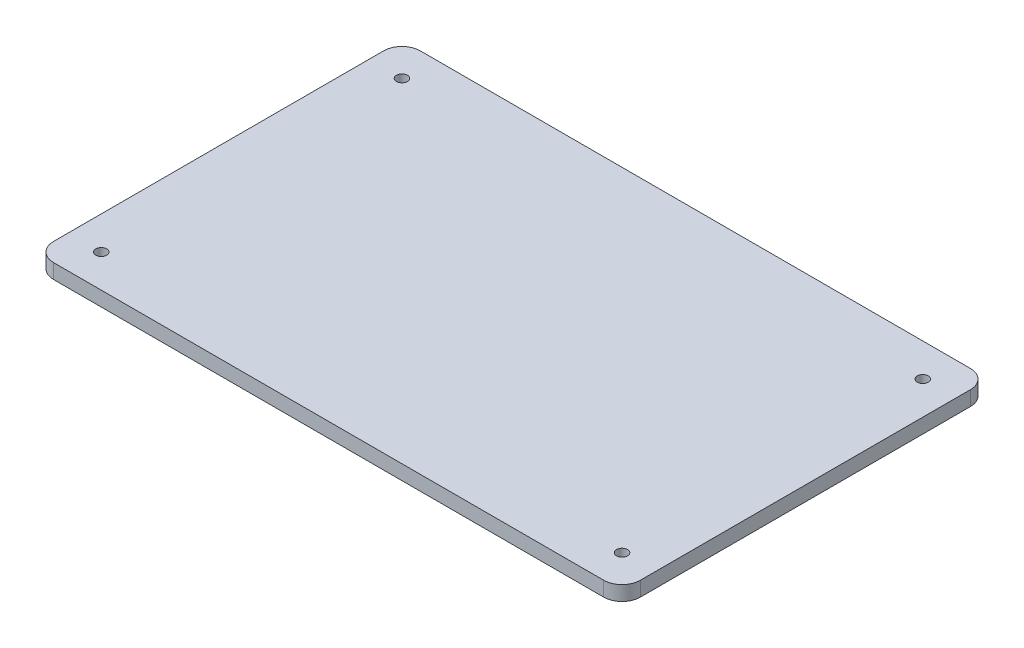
ISO-10303-21;
HEADER;
FILE_DESCRIPTION(('STEP AP214'),'2;1');
FILE_NAME('part.step','',(''),(''),'','','');
FILE_SCHEMA(('AUTOMOTIVE_DESIGN { 1 0 10303 214 1 1 1 1 }'));
ENDSEC;
DATA;
#1=APPLICATION_CONTEXT('core data for automotive mechanical design processes');
#2=APPLICATION_PROTOCOL_DEFINITION('international standard','automotive_design',2000,#1);
#3=PRODUCT_CONTEXT('',#1,'mechanical');
#4=PRODUCT('Part','Part','',(#3));
#5=PRODUCT_RELATED_PRODUCT_CATEGORY('part','',(#4));
#6=PRODUCT_DEFINITION_FORMATION('','',#4);
#7=PRODUCT_DEFINITION_CONTEXT('part definition',#1,'design');
#8=PRODUCT_DEFINITION('design','',#6,#7);
#9=PRODUCT_DEFINITION_SHAPE('','',#8);
#10=(LENGTH_UNIT() NAMED_UNIT(*) SI_UNIT(.MILLI.,.METRE.));
#11=(NAMED_UNIT(*) PLANE_ANGLE_UNIT() SI_UNIT($,.RADIAN.));
#12=(NAMED_UNIT(*) SI_UNIT($,.STERADIAN.) SOLID_ANGLE_UNIT());
#13=UNCERTAINTY_MEASURE_WITH_UNIT(LENGTH_MEASURE(1.E-05),#10,'distance_accuracy_value','');
#14=(GEOMETRIC_REPRESENTATION_CONTEXT(3) GLOBAL_UNCERTAINTY_ASSIGNED_CONTEXT((#13)) GLOBAL_UNIT_ASSIGNED_CONTEXT((#10,
#11,#12)) REPRESENTATION_CONTEXT('',''));
#15=CARTESIAN_POINT('',(0.,0.,0.));
#16=DIRECTION('',(0.,0.,1.));
#17=DIRECTION('',(1.,0.,0.));
#18=AXIS2_PLACEMENT_3D('',#15,#16,#17);
#19=CARTESIAN_POINT('',(0.,4.,0.));
#20=DIRECTION('',(1.,0.,0.));
#21=DIRECTION('',(0.,0.,-1.));
#22=AXIS2_PLACEMENT_3D('',#19,#20,#21);
#23=PLANE('',#22);
#24=DIRECTION('',(0.,0.,1.));
#25=VECTOR('',#24,1.);
#26=CARTESIAN_POINT('',(0.,4.,0.));
#27=LINE('',#26,#25);
#28=CARTESIAN_POINT('',(0.,4.,5.));
#29=VERTEX_POINT('',#28);
#30=CARTESIAN_POINT('',(0.,4.,95.));
#31=VERTEX_POINT('',#30);
#32=EDGE_CURVE('E149',#29,#31,#27,.T.);
#33=ORIENTED_EDGE('',*,*,#32,.F.);
#34=DIRECTION('',(0.,-1.,0.));
#35=VECTOR('',#34,1.);
#36=CARTESIAN_POINT('',(0.,4.,5.));
#37=LINE('',#36,#35);
#38=CARTESIAN_POINT('',(0.,0.,5.));
#39=VERTEX_POINT('',#38);
#40=EDGE_CURVE('E171',#29,#39,#37,.T.);
#41=ORIENTED_EDGE('',*,*,#40,.T.);
#42=DIRECTION('',(0.,0.,1.));
#43=VECTOR('',#42,1.);
#44=CARTESIAN_POINT('',(0.,0.,0.));
#45=LINE('',#44,#43);
#46=CARTESIAN_POINT('',(0.,0.,95.));
#47=VERTEX_POINT('',#46);
#48=EDGE_CURVE('E137',#39,#47,#45,.T.);
#49=ORIENTED_EDGE('',*,*,#48,.T.);
#50=DIRECTION('',(0.,-1.,0.));
#51=VECTOR('',#50,1.);
#52=CARTESIAN_POINT('',(0.,4.,95.));
#53=LINE('',#52,#51);
#54=EDGE_CURVE('E124',#47,#31,#53,.F.);
#55=ORIENTED_EDGE('',*,*,#54,.T.);
#56=EDGE_LOOP('',(#33,#41,#49,#55));
#57=FACE_BOUND('',#56,.T.);
#58=ADVANCED_FACE('F51',(#57),#23,.F.);
#59=CARTESIAN_POINT('',(0.,4.,100.));
#60=DIRECTION('',(0.,0.,-1.));
#61=DIRECTION('',(-1.,0.,0.));
#62=AXIS2_PLACEMENT_3D('',#59,#60,#61);
#63=PLANE('',#62);
#64=DIRECTION('',(1.,0.,0.));
#65=VECTOR('',#64,1.);
#66=CARTESIAN_POINT('',(0.,0.,100.));
#67=LINE('',#66,#65);
#68=CARTESIAN_POINT('',(5.00000000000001,0.,100.));
#69=VERTEX_POINT('',#68);
#70=CARTESIAN_POINT('',(155.,0.,100.));
#71=VERTEX_POINT('',#70);
#72=EDGE_CURVE('E129',#69,#71,#67,.T.);
#73=ORIENTED_EDGE('',*,*,#72,.T.);
#74=DIRECTION('',(0.,-1.,0.));
#75=VECTOR('',#74,1.);
#76=CARTESIAN_POINT('',(155.,4.,100.));
#77=LINE('',#76,#75);
#78=CARTESIAN_POINT('',(155.,4.,100.));
#79=VERTEX_POINT('',#78);
#80=EDGE_CURVE('E60',#71,#79,#77,.F.);
#81=ORIENTED_EDGE('',*,*,#80,.T.);
#82=DIRECTION('',(1.,0.,0.));
#83=VECTOR('',#82,1.);
#84=CARTESIAN_POINT('',(0.,4.,100.));
#85=LINE('',#84,#83);
#86=CARTESIAN_POINT('',(5.00000000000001,4.,100.));
#87=VERTEX_POINT('',#86);
#88=EDGE_CURVE('E130',#87,#79,#85,.T.);
#89=ORIENTED_EDGE('',*,*,#88,.F.);
#90=DIRECTION('',(0.,-1.,0.));
#91=VECTOR('',#90,1.);
#92=CARTESIAN_POINT('',(5.00000000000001,4.,100.));
#93=LINE('',#92,#91);
#94=EDGE_CURVE('E122',#87,#69,#93,.T.);
#95=ORIENTED_EDGE('',*,*,#94,.T.);
#96=EDGE_LOOP('',(#73,#81,#89,#95));
#97=FACE_BOUND('',#96,.T.);
#98=ADVANCED_FACE('F128',(#97),#63,.F.);
#99=CARTESIAN_POINT('',(160.,4.,0.));
#100=DIRECTION('',(-1.,0.,0.));
#101=DIRECTION('',(0.,0.,1.));
#102=AXIS2_PLACEMENT_3D('',#99,#100,#101);
#103=PLANE('',#102);
#104=DIRECTION('',(0.,0.,-1.));
#105=VECTOR('',#104,1.);
#106=CARTESIAN_POINT('',(160.,4.,0.));
#107=LINE('',#106,#105);
#108=CARTESIAN_POINT('',(160.,4.,95.));
#109=VERTEX_POINT('',#108);
#110=CARTESIAN_POINT('',(160.,4.,5.));
#111=VERTEX_POINT('',#110);
#112=EDGE_CURVE('E193',#109,#111,#107,.T.);
#113=ORIENTED_EDGE('',*,*,#112,.F.);
#114=DIRECTION('',(0.,-1.,0.));
#115=VECTOR('',#114,1.);
#116=CARTESIAN_POINT('',(160.,4.,95.));
#117=LINE('',#116,#115);
#118=CARTESIAN_POINT('',(160.,0.,95.));
#119=VERTEX_POINT('',#118);
#120=EDGE_CURVE('E184',#109,#119,#117,.T.);
#121=ORIENTED_EDGE('',*,*,#120,.T.);
#122=DIRECTION('',(0.,0.,-1.));
#123=VECTOR('',#122,1.);
#124=CARTESIAN_POINT('',(160.,0.,0.));
#125=LINE('',#124,#123);
#126=CARTESIAN_POINT('',(160.,0.,5.));
#127=VERTEX_POINT('',#126);
#128=EDGE_CURVE('E136',#119,#127,#125,.T.);
#129=ORIENTED_EDGE('',*,*,#128,.T.);
#130=DIRECTION('',(0.,-1.,0.));
#131=VECTOR('',#130,1.);
#132=CARTESIAN_POINT('',(160.,4.,5.));
#133=LINE('',#132,#131);
#134=EDGE_CURVE('E164',#127,#111,#133,.F.);
#135=ORIENTED_EDGE('',*,*,#134,.T.);
#136=EDGE_LOOP('',(#113,#121,#129,#135));
#137=FACE_BOUND('',#136,.T.);
#138=ADVANCED_FACE('F248',(#137),#103,.F.);
#139=CARTESIAN_POINT('',(0.,4.,0.));
#140=DIRECTION('',(0.,0.,1.));
#141=DIRECTION('',(1.,0.,0.));
#142=AXIS2_PLACEMENT_3D('',#139,#140,#141);
#143=PLANE('',#142);
#144=DIRECTION('',(-1.,0.,0.));
#145=VECTOR('',#144,1.);
#146=CARTESIAN_POINT('',(0.,0.,0.));
#147=LINE('',#146,#145);
#148=CARTESIAN_POINT('',(155.,0.,0.));
#149=VERTEX_POINT('',#148);
#150=CARTESIAN_POINT('',(5.,0.,0.));
#151=VERTEX_POINT('',#150);
#152=EDGE_CURVE('E141',#149,#151,#147,.T.);
#153=ORIENTED_EDGE('',*,*,#152,.T.);
#154=DIRECTION('',(0.,-1.,0.));
#155=VECTOR('',#154,1.);
#156=CARTESIAN_POINT('',(5.,4.,0.));
#157=LINE('',#156,#155);
#158=CARTESIAN_POINT('',(5.,4.,0.));
#159=VERTEX_POINT('',#158);
#160=EDGE_CURVE('E178',#151,#159,#157,.F.);
#161=ORIENTED_EDGE('',*,*,#160,.T.);
#162=DIRECTION('',(-1.,0.,0.));
#163=VECTOR('',#162,1.);
#164=CARTESIAN_POINT('',(0.,4.,0.));
#165=LINE('',#164,#163);
#166=CARTESIAN_POINT('',(155.,4.,0.));
#167=VERTEX_POINT('',#166);
#168=EDGE_CURVE('E132',#167,#159,#165,.T.);
#169=ORIENTED_EDGE('',*,*,#168,.F.);
#170=DIRECTION('',(0.,-1.,0.));
#171=VECTOR('',#170,1.);
#172=CARTESIAN_POINT('',(155.,4.,0.));
#173=LINE('',#172,#171);
#174=EDGE_CURVE('E156',#167,#149,#173,.T.);
#175=ORIENTED_EDGE('',*,*,#174,.T.);
#176=EDGE_LOOP('',(#153,#161,#169,#175));
#177=FACE_BOUND('',#176,.T.);
#178=ADVANCED_FACE('F239',(#177),#143,.F.);
#179=CARTESIAN_POINT('',(0.,4.,0.));
#180=DIRECTION('',(0.,1.,0.));
#181=DIRECTION('',(0.,0.,1.));
#182=AXIS2_PLACEMENT_3D('',#179,#180,#181);
#183=PLANE('',#182);
#184=CARTESIAN_POINT('',(9.,4.,8.99999999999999));
#185=DIRECTION('',(0.,1.,0.));
#186=DIRECTION('',(0.,0.,-1.));
#187=AXIS2_PLACEMENT_3D('',#184,#185,#186);
#188=CIRCLE('',#187,1.5);
#189=CARTESIAN_POINT('',(9.,4.,7.49999999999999));
#190=VERTEX_POINT('',#189);
#191=EDGE_CURVE('E206',#190,#190,#188,.T.);
#192=ORIENTED_EDGE('',*,*,#191,.F.);
#193=EDGE_LOOP('',(#192));
#194=FACE_BOUND('',#193,.T.);
#195=CARTESIAN_POINT('',(151.,4.,91.));
#196=DIRECTION('',(0.,1.,0.));
#197=DIRECTION('',(0.,0.,-1.));
#198=AXIS2_PLACEMENT_3D('',#195,#196,#197);
#199=CIRCLE('',#198,1.50000000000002);
#200=CARTESIAN_POINT('',(151.,4.,89.5));
#201=VERTEX_POINT('',#200);
#202=EDGE_CURVE('E214',#201,#201,#199,.T.);
#203=ORIENTED_EDGE('',*,*,#202,.F.);
#204=EDGE_LOOP('',(#203));
#205=FACE_BOUND('',#204,.T.);
#206=CARTESIAN_POINT('',(151.,4.,8.99999999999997));
#207=DIRECTION('',(0.,1.,0.));
#208=DIRECTION('',(0.,0.,1.));
#209=AXIS2_PLACEMENT_3D('',#206,#207,#208);
#210=CIRCLE('',#209,1.50000000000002);
#211=CARTESIAN_POINT('',(151.,4.,10.5));
#212=VERTEX_POINT('',#211);
#213=EDGE_CURVE('E215',#212,#212,#210,.T.);
#214=ORIENTED_EDGE('',*,*,#213,.F.);
#215=EDGE_LOOP('',(#214));
#216=FACE_BOUND('',#215,.T.);
#217=CARTESIAN_POINT('',(9.,4.,91.));
#218=DIRECTION('',(0.,1.,0.));
#219=DIRECTION('',(0.,0.,1.));
#220=AXIS2_PLACEMENT_3D('',#217,#218,#219);
#221=CIRCLE('',#220,1.5);
#222=CARTESIAN_POINT('',(9.,4.,92.5));
#223=VERTEX_POINT('',#222);
#224=EDGE_CURVE('E202',#223,#223,#221,.T.);
#225=ORIENTED_EDGE('',*,*,#224,.F.);
#226=EDGE_LOOP('',(#225));
#227=FACE_BOUND('',#226,.T.);
#228=ORIENTED_EDGE('',*,*,#88,.T.);
#229=CARTESIAN_POINT('',(155.,4.,95.));
#230=DIRECTION('',(0.,1.,0.));
#231=DIRECTION('',(0.,0.,1.));
#232=AXIS2_PLACEMENT_3D('',#229,#230,#231);
#233=CIRCLE('',#232,5.);
#234=EDGE_CURVE('E11',#79,#109,#233,.T.);
#235=ORIENTED_EDGE('',*,*,#234,.T.);
#236=ORIENTED_EDGE('',*,*,#112,.T.);
#237=CARTESIAN_POINT('',(155.,4.,5.));
#238=DIRECTION('',(0.,1.,0.));
#239=DIRECTION('',(0.,0.,1.));
#240=AXIS2_PLACEMENT_3D('',#237,#238,#239);
#241=CIRCLE('',#240,5.);
#242=EDGE_CURVE('E168',#111,#167,#241,.T.);
#243=ORIENTED_EDGE('',*,*,#242,.T.);
#244=ORIENTED_EDGE('',*,*,#168,.T.);
#245=CARTESIAN_POINT('',(5.,4.,5.));
#246=DIRECTION('',(0.,1.,0.));
#247=DIRECTION('',(0.,0.,1.));
#248=AXIS2_PLACEMENT_3D('',#245,#246,#247);
#249=CIRCLE('',#248,5.);
#250=EDGE_CURVE('E181',#159,#29,#249,.T.);
#251=ORIENTED_EDGE('',*,*,#250,.T.);
#252=ORIENTED_EDGE('',*,*,#32,.T.);
#253=CARTESIAN_POINT('',(5.00000000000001,4.,95.));
#254=DIRECTION('',(0.,1.,0.));
#255=DIRECTION('',(0.,0.,1.));
#256=AXIS2_PLACEMENT_3D('',#253,#254,#255);
#257=CIRCLE('',#256,5.);
#258=EDGE_CURVE('E153',#31,#87,#257,.T.);
#259=ORIENTED_EDGE('',*,*,#258,.T.);
#260=EDGE_LOOP('',(#228,#235,#236,#243,#244,#251,#252,#259));
#261=FACE_BOUND('',#260,.T.);
#262=ADVANCED_FACE('F236',(#194,#205,#216,#227,#261),#183,.T.);
#263=CARTESIAN_POINT('',(0.,0.,0.));
#264=DIRECTION('',(0.,1.,0.));
#265=DIRECTION('',(0.,0.,1.));
#266=AXIS2_PLACEMENT_3D('',#263,#264,#265);
#267=PLANE('',#266);
#268=CARTESIAN_POINT('',(9.,0.,8.99999999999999));
#269=DIRECTION('',(0.,1.,0.));
#270=DIRECTION('',(0.,0.,-1.));
#271=AXIS2_PLACEMENT_3D('',#268,#269,#270);
#272=CIRCLE('',#271,1.5);
#273=CARTESIAN_POINT('',(9.,0.,7.49999999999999));
#274=VERTEX_POINT('',#273);
#275=EDGE_CURVE('E219',#274,#274,#272,.T.);
#276=ORIENTED_EDGE('',*,*,#275,.T.);
#277=EDGE_LOOP('',(#276));
#278=FACE_BOUND('',#277,.T.);
#279=CARTESIAN_POINT('',(151.,0.,91.));
#280=DIRECTION('',(0.,1.,0.));
#281=DIRECTION('',(0.,0.,-1.));
#282=AXIS2_PLACEMENT_3D('',#279,#280,#281);
#283=CIRCLE('',#282,1.50000000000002);
#284=CARTESIAN_POINT('',(151.,0.,89.5));
#285=VERTEX_POINT('',#284);
#286=EDGE_CURVE('E210',#285,#285,#283,.T.);
#287=ORIENTED_EDGE('',*,*,#286,.T.);
#288=EDGE_LOOP('',(#287));
#289=FACE_BOUND('',#288,.T.);
#290=CARTESIAN_POINT('',(151.,0.,8.99999999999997));
#291=DIRECTION('',(0.,1.,0.));
#292=DIRECTION('',(0.,0.,1.));
#293=AXIS2_PLACEMENT_3D('',#290,#291,#292);
#294=CIRCLE('',#293,1.50000000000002);
#295=CARTESIAN_POINT('',(151.,0.,10.5));
#296=VERTEX_POINT('',#295);
#297=EDGE_CURVE('E226',#296,#296,#294,.T.);
#298=ORIENTED_EDGE('',*,*,#297,.T.);
#299=EDGE_LOOP('',(#298));
#300=FACE_BOUND('',#299,.T.);
#301=CARTESIAN_POINT('',(9.,0.,91.));
#302=DIRECTION('',(0.,1.,0.));
#303=DIRECTION('',(0.,0.,1.));
#304=AXIS2_PLACEMENT_3D('',#301,#302,#303);
#305=CIRCLE('',#304,1.5);
#306=CARTESIAN_POINT('',(9.,0.,92.5));
#307=VERTEX_POINT('',#306);
#308=EDGE_CURVE('E143',#307,#307,#305,.T.);
#309=ORIENTED_EDGE('',*,*,#308,.T.);
#310=EDGE_LOOP('',(#309));
#311=FACE_BOUND('',#310,.T.);
#312=ORIENTED_EDGE('',*,*,#128,.F.);
#313=CARTESIAN_POINT('',(155.,0.,95.));
#314=DIRECTION('',(0.,1.,0.));
#315=DIRECTION('',(0.,0.,1.));
#316=AXIS2_PLACEMENT_3D('',#313,#314,#315);
#317=CIRCLE('',#316,5.);
#318=EDGE_CURVE('E74',#119,#71,#317,.F.);
#319=ORIENTED_EDGE('',*,*,#318,.T.);
#320=ORIENTED_EDGE('',*,*,#72,.F.);
#321=CARTESIAN_POINT('',(5.00000000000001,0.,95.));
#322=DIRECTION('',(0.,1.,0.));
#323=DIRECTION('',(0.,0.,1.));
#324=AXIS2_PLACEMENT_3D('',#321,#322,#323);
#325=CIRCLE('',#324,5.);
#326=EDGE_CURVE('E118',#69,#47,#325,.F.);
#327=ORIENTED_EDGE('',*,*,#326,.T.);
#328=ORIENTED_EDGE('',*,*,#48,.F.);
#329=CARTESIAN_POINT('',(5.,0.,5.));
#330=DIRECTION('',(0.,1.,0.));
#331=DIRECTION('',(0.,0.,1.));
#332=AXIS2_PLACEMENT_3D('',#329,#330,#331);
#333=CIRCLE('',#332,5.);
#334=EDGE_CURVE('E175',#39,#151,#333,.F.);
#335=ORIENTED_EDGE('',*,*,#334,.T.);
#336=ORIENTED_EDGE('',*,*,#152,.F.);
#337=CARTESIAN_POINT('',(155.,0.,5.));
#338=DIRECTION('',(0.,1.,0.));
#339=DIRECTION('',(0.,0.,1.));
#340=AXIS2_PLACEMENT_3D('',#337,#338,#339);
#341=CIRCLE('',#340,5.);
#342=EDGE_CURVE('E160',#149,#127,#341,.F.);
#343=ORIENTED_EDGE('',*,*,#342,.T.);
#344=EDGE_LOOP('',(#312,#319,#320,#327,#328,#335,#336,#343));
#345=FACE_BOUND('',#344,.T.);
#346=ADVANCED_FACE('F134',(#278,#289,#300,#311,#345),#267,.F.);
#347=CARTESIAN_POINT('',(9.,0.,91.));
#348=DIRECTION('',(0.,1.,0.));
#349=DIRECTION('',(0.,0.,1.));
#350=AXIS2_PLACEMENT_3D('',#347,#348,#349);
#351=CYLINDRICAL_SURFACE('',#350,1.5);
#352=ORIENTED_EDGE('',*,*,#308,.F.);
#353=EDGE_LOOP('',(#352));
#354=FACE_BOUND('',#353,.T.);
#355=ORIENTED_EDGE('',*,*,#224,.T.);
#356=EDGE_LOOP('',(#355));
#357=FACE_BOUND('',#356,.T.);
#358=ADVANCED_FACE('F329',(#354,#357),#351,.F.);
#359=CARTESIAN_POINT('',(151.,0.,8.99999999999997));
#360=DIRECTION('',(0.,1.,0.));
#361=DIRECTION('',(0.,0.,1.));
#362=AXIS2_PLACEMENT_3D('',#359,#360,#361);
#363=CYLINDRICAL_SURFACE('',#362,1.50000000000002);
#364=ORIENTED_EDGE('',*,*,#297,.F.);
#365=EDGE_LOOP('',(#364));
#366=FACE_BOUND('',#365,.T.);
#367=ORIENTED_EDGE('',*,*,#213,.T.);
#368=EDGE_LOOP('',(#367));
#369=FACE_BOUND('',#368,.T.);
#370=ADVANCED_FACE('F234',(#366,#369),#363,.F.);
#371=CARTESIAN_POINT('',(151.,0.,91.));
#372=DIRECTION('',(0.,1.,0.));
#373=DIRECTION('',(0.,0.,1.));
#374=AXIS2_PLACEMENT_3D('',#371,#372,#373);
#375=CYLINDRICAL_SURFACE('',#374,1.50000000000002);
#376=ORIENTED_EDGE('',*,*,#286,.F.);
#377=EDGE_LOOP('',(#376));
#378=FACE_BOUND('',#377,.T.);
#379=ORIENTED_EDGE('',*,*,#202,.T.);
#380=EDGE_LOOP('',(#379));
#381=FACE_BOUND('',#380,.T.);
#382=ADVANCED_FACE('F310',(#378,#381),#375,.F.);
#383=CARTESIAN_POINT('',(9.,0.,8.99999999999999));
#384=DIRECTION('',(0.,1.,0.));
#385=DIRECTION('',(0.,0.,1.));
#386=AXIS2_PLACEMENT_3D('',#383,#384,#385);
#387=CYLINDRICAL_SURFACE('',#386,1.5);
#388=ORIENTED_EDGE('',*,*,#275,.F.);
#389=EDGE_LOOP('',(#388));
#390=FACE_BOUND('',#389,.T.);
#391=ORIENTED_EDGE('',*,*,#191,.T.);
#392=EDGE_LOOP('',(#391));
#393=FACE_BOUND('',#392,.T.);
#394=ADVANCED_FACE('F273',(#390,#393),#387,.F.);
#395=CARTESIAN_POINT('',(5.00000000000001,4.,95.));
#396=DIRECTION('',(0.,-1.,0.));
#397=DIRECTION('',(0.,0.,-1.));
#398=AXIS2_PLACEMENT_3D('',#395,#396,#397);
#399=CYLINDRICAL_SURFACE('',#398,5.);
#400=ORIENTED_EDGE('',*,*,#258,.F.);
#401=ORIENTED_EDGE('',*,*,#54,.F.);
#402=ORIENTED_EDGE('',*,*,#326,.F.);
#403=ORIENTED_EDGE('',*,*,#94,.F.);
#404=EDGE_LOOP('',(#400,#401,#402,#403));
#405=FACE_BOUND('',#404,.T.);
#406=ADVANCED_FACE('F121',(#405),#399,.T.);
#407=CARTESIAN_POINT('',(155.,4.,5.));
#408=DIRECTION('',(0.,-1.,0.));
#409=DIRECTION('',(0.,0.,-1.));
#410=AXIS2_PLACEMENT_3D('',#407,#408,#409);
#411=CYLINDRICAL_SURFACE('',#410,5.);
#412=ORIENTED_EDGE('',*,*,#242,.F.);
#413=ORIENTED_EDGE('',*,*,#134,.F.);
#414=ORIENTED_EDGE('',*,*,#342,.F.);
#415=ORIENTED_EDGE('',*,*,#174,.F.);
#416=EDGE_LOOP('',(#412,#413,#414,#415));
#417=FACE_BOUND('',#416,.T.);
#418=ADVANCED_FACE('F254',(#417),#411,.T.);
#419=CARTESIAN_POINT('',(5.,4.,5.));
#420=DIRECTION('',(0.,-1.,0.));
#421=DIRECTION('',(0.,0.,-1.));
#422=AXIS2_PLACEMENT_3D('',#419,#420,#421);
#423=CYLINDRICAL_SURFACE('',#422,5.);
#424=ORIENTED_EDGE('',*,*,#250,.F.);
#425=ORIENTED_EDGE('',*,*,#160,.F.);
#426=ORIENTED_EDGE('',*,*,#334,.F.);
#427=ORIENTED_EDGE('',*,*,#40,.F.);
#428=EDGE_LOOP('',(#424,#425,#426,#427));
#429=FACE_BOUND('',#428,.T.);
#430=ADVANCED_FACE('F260',(#429),#423,.T.);
#431=CARTESIAN_POINT('',(155.,4.,95.));
#432=DIRECTION('',(0.,-1.,0.));
#433=DIRECTION('',(0.,0.,-1.));
#434=AXIS2_PLACEMENT_3D('',#431,#432,#433);
#435=CYLINDRICAL_SURFACE('',#434,5.);
#436=ORIENTED_EDGE('',*,*,#234,.F.);
#437=ORIENTED_EDGE('',*,*,#80,.F.);
#438=ORIENTED_EDGE('',*,*,#318,.F.);
#439=ORIENTED_EDGE('',*,*,#120,.F.);
#440=EDGE_LOOP('',(#436,#437,#438,#439));
#441=FACE_BOUND('',#440,.T.);
#442=ADVANCED_FACE('F53',(#441),#435,.T.);
#443=CLOSED_SHELL('',(#58,#98,#138,#178,#262,#346,#358,#370,#382,#394,#406,#418,#430,#442));
#444=MANIFOLD_SOLID_BREP('B2',#443);
#445=ADVANCED_BREP_SHAPE_REPRESENTATION('',(#18,#444),#14);
#446=SHAPE_DEFINITION_REPRESENTATION(#9,#445);
ENDSEC;
END-ISO-10303-21;
